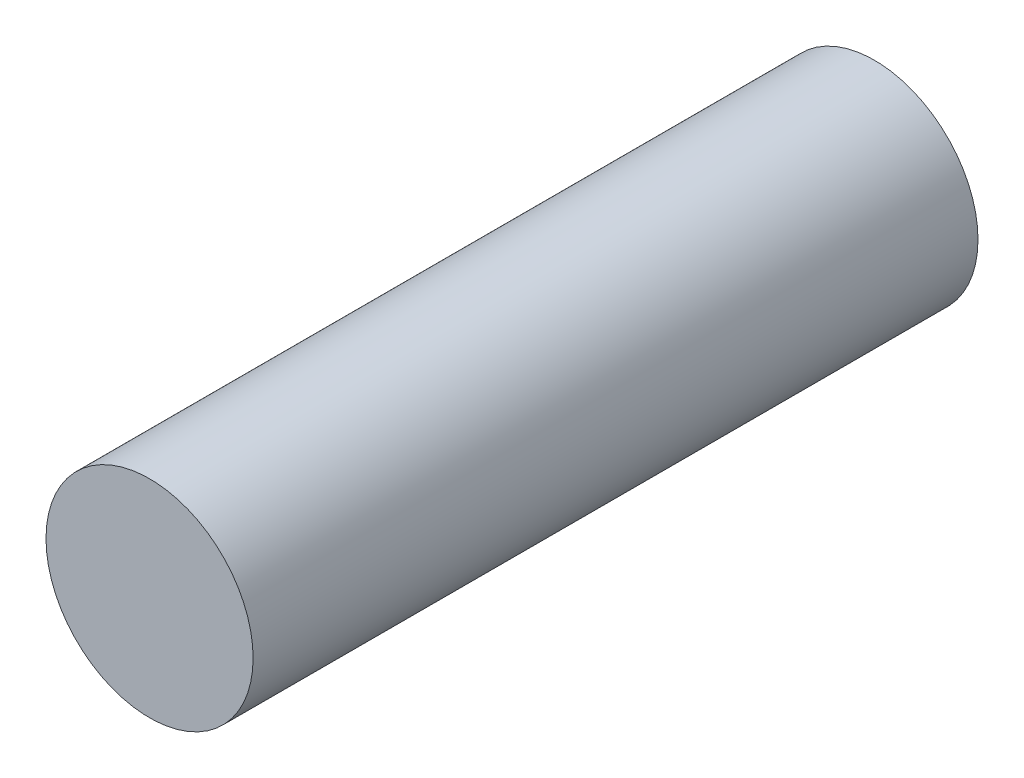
from build123d import *

# Parameters (mm, degrees)
SKIZZE1_R               = 10
LINEAR_AUSTRAGEN1_DEPTH = 70


with BuildPart() as part:
    # Skizze1 → Linear austragen1 (new body)
    with BuildSketch(Plane.XY):
        with Locations((0, 20)):
            Circle(SKIZZE1_R)
    extrude(amount=LINEAR_AUSTRAGEN1_DEPTH)


solid = part.part
